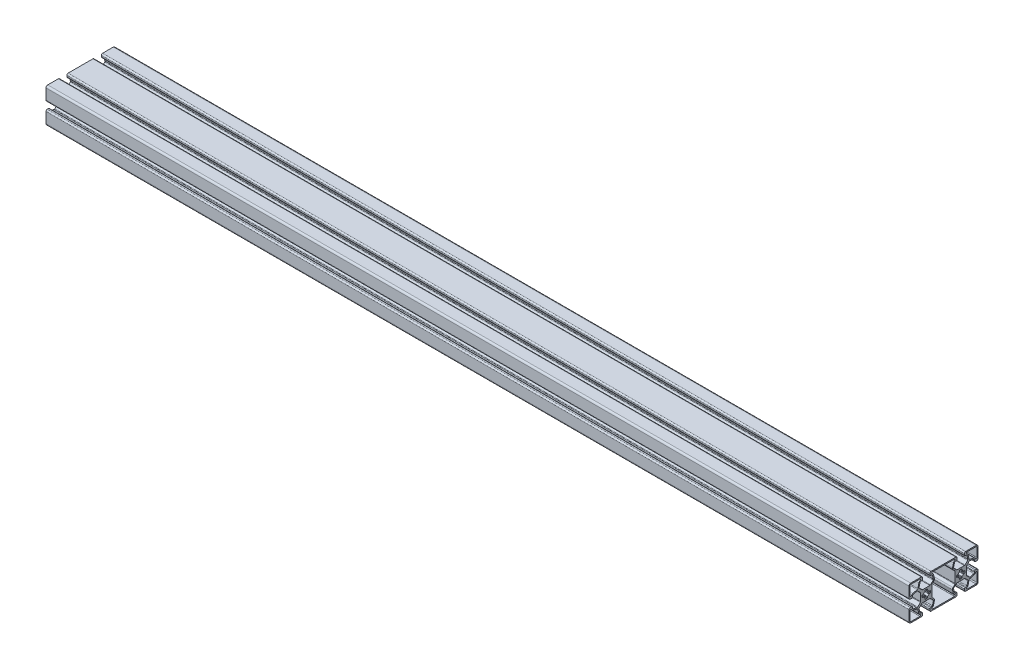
from build123d import *

# Parameters (mm, degrees)
EXTRUDE_1_DEPTH = 1000


with BuildPart() as part:
    # Sketch 1 → Extrude 1 (new body)
    with BuildSketch(Plane(origin=(0, 0, 0), x_dir=(0, 0, -1), z_dir=(1, 0, 0))):
        with BuildLine():
            Line((34.849999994, 15.999999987), (33.78085943, 15.999999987))
            ThreePointArc((33.78085943, 15.999999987), (33.165406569, 15.788173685), (32.810691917, 15.242435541))
            Line((32.810691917, 15.242435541), (31.705446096, 10.819513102))
            ThreePointArc((31.705446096, 10.819513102), (31.711912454, 10.310094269), (31.968506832, 9.869970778))
            Line((31.968506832, 9.869970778), (35.045584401, 6.792893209))
            ThreePointArc((35.045584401, 6.792893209), (35.370007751, 6.576120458), (35.752691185, 6.499999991))
            Line((35.752691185, 6.499999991), (44.2473088, 6.499999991))
            ThreePointArc((44.2473088, 6.499999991), (44.629992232, 6.576120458), (44.954415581, 6.792893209))
            Line((44.954415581, 6.792893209), (48.031493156, 9.869970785))
            ThreePointArc((48.031493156, 9.869970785), (48.288087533, 10.310094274), (48.294553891, 10.819513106))
            Line((48.294553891, 10.819513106), (47.189308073, 15.242435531))
            ThreePointArc((47.189308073, 15.242435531), (46.834593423, 15.788173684), (46.219140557, 15.999999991))
            Line((46.219140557, 15.999999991), (45.149999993, 15.999999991))
            ThreePointArc((45.149999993, 15.999999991), (44.442893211, 16.292893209), (44.149999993, 16.999999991))
            Line((44.149999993, 16.999999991), (44.149999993, 18.499999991))
            ThreePointArc((44.149999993, 18.499999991), (44.589339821, 19.560660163), (45.649999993, 19.999999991))
            Line((45.649999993, 19.999999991), (57.999999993, 19.999999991))
            ThreePointArc((57.999999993, 19.999999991), (59.414213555, 19.414213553), (59.999999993, 17.999999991))
            Line((59.999999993, 17.999999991), (59.999999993, 5.649999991))
            ThreePointArc((59.999999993, 5.649999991), (59.560660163, 4.589339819), (58.499999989, 4.149999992))
            Line((58.499999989, 4.149999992), (56.999999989, 4.149999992))
            ThreePointArc((56.999999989, 4.149999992), (56.292893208, 4.442893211), (55.999999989, 5.149999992))
            Line((55.999999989, 5.149999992), (55.999999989, 6.219140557))
            ThreePointArc((55.999999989, 6.219140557), (55.788173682, 6.834593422), (55.24243553, 7.189308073))
            Line((55.24243553, 7.189308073), (50.819513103, 8.294553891))
            ThreePointArc((50.819513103, 8.294553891), (50.310094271, 8.288087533), (49.869970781, 8.031493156))
            Line((49.869970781, 8.031493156), (46.792893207, 4.954415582))
            ThreePointArc((46.792893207, 4.954415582), (46.576120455, 4.629992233), (46.499999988, 4.2473088))
            Line((46.499999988, 4.2473088), (46.499999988, -4.247308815))
            ThreePointArc((46.499999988, -4.247308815), (46.576120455, -4.629992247), (46.792893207, -4.954415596))
            Line((46.792893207, -4.954415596), (49.869970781, -8.03149317))
            ThreePointArc((49.869970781, -8.03149317), (50.310094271, -8.288087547), (50.819513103, -8.294553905))
            Line((50.819513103, -8.294553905), (55.242435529, -7.189308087))
            ThreePointArc((55.242435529, -7.189308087), (55.788173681, -6.834593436), (55.999999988, -6.219140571))
            Line((55.999999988, -6.219140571), (55.999999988, -5.150000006))
            ThreePointArc((55.999999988, -5.150000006), (56.292893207, -4.442893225), (56.999999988, -4.150000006))
            Line((56.999999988, -4.150000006), (58.499999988, -4.150000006))
            ThreePointArc((58.499999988, -4.150000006), (59.56066016, -4.589339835), (59.999999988, -5.650000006))
            Line((59.999999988, -5.650000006), (59.999999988, -18.000000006))
            ThreePointArc((59.999999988, -18.000000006), (59.414213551, -19.414213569), (57.999999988, -20.000000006))
            Line((57.999999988, -20.000000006), (45.649999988, -20.000000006))
            ThreePointArc((45.649999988, -20.000000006), (44.589339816, -19.560660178), (44.149999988, -18.500000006))
            Line((44.149999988, -18.500000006), (44.149999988, -17.000000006))
            ThreePointArc((44.149999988, -17.000000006), (44.442893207, -16.292893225), (45.149999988, -16.000000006))
            Line((45.149999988, -16.000000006), (46.219140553, -16.000000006))
            ThreePointArc((46.219140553, -16.000000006), (46.834593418, -15.788173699), (47.189308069, -15.242435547))
            Line((47.189308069, -15.242435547), (48.294553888, -10.819513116))
            ThreePointArc((48.294553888, -10.819513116), (48.28808753, -10.310094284), (48.031493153, -9.869970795))
            Line((48.031493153, -9.869970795), (44.95441558, -6.792893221))
            ThreePointArc((44.95441558, -6.792893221), (44.62999223, -6.57612047), (44.247308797, -6.500000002))
            Line((44.247308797, -6.500000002), (35.752691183, -6.500000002))
            ThreePointArc((35.752691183, -6.500000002), (35.370007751, -6.576120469), (35.045584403, -6.79289322))
            Line((35.045584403, -6.79289322), (31.96850683, -9.869970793))
            ThreePointArc((31.96850683, -9.869970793), (31.711912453, -10.310094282), (31.705446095, -10.819513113))
            Line((31.705446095, -10.819513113), (32.810691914, -15.242435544))
            ThreePointArc((32.810691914, -15.242435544), (33.165406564, -15.788173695), (33.780859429, -16.000000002))
            Line((33.780859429, -16.000000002), (34.849999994, -16.000000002))
            ThreePointArc((34.849999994, -16.000000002), (35.557106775, -16.292893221), (35.849999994, -17.000000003))
            Line((35.849999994, -17.000000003), (35.849999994, -18.500000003))
            ThreePointArc((35.849999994, -18.500000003), (35.410660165, -19.560660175), (34.349999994, -20.000000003))
            Line((34.349999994, -20.000000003), (5.649999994, -20.000000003))
            ThreePointArc((5.649999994, -20.000000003), (4.589339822, -19.560660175), (4.149999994, -18.500000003))
            Line((4.149999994, -18.500000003), (4.149999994, -17.000000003))
            ThreePointArc((4.149999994, -17.000000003), (4.442893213, -16.292893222), (5.149999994, -16.000000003))
            Line((5.149999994, -16.000000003), (6.219140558, -16.000000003))
            ThreePointArc((6.219140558, -16.000000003), (6.834593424, -15.788173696), (7.189308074, -15.242435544))
            Line((7.189308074, -15.242435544), (8.294553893, -10.819513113))
            ThreePointArc((8.294553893, -10.819513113), (8.288087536, -10.310094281), (8.031493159, -9.869970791))
            Line((8.031493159, -9.869970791), (4.954415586, -6.792893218))
            ThreePointArc((4.954415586, -6.792893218), (4.629992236, -6.576120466), (4.247308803, -6.499999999))
            Line((4.247308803, -6.499999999), (-4.247308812, -6.499999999))
            ThreePointArc((-4.247308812, -6.499999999), (-4.629992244, -6.576120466), (-4.954415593, -6.792893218))
            Line((-4.954415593, -6.792893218), (-8.031493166, -9.869970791))
            ThreePointArc((-8.031493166, -9.869970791), (-8.288087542, -10.310094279), (-8.2945539, -10.81951311))
            Line((-8.2945539, -10.81951311), (-7.18930808, -15.24243554))
            ThreePointArc((-7.18930808, -15.24243554), (-6.83459343, -15.788173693), (-6.219140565, -16))
            Line((-6.219140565, -16), (-5.15, -16))
            ThreePointArc((-5.15, -16), (-4.442893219, -16.292893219), (-4.15, -17))
            Line((-4.15, -17), (-4.15, -18.5))
            ThreePointArc((-4.15, -18.5), (-4.589339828, -19.560660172), (-5.65, -20))
            Line((-5.65, -20), (-18, -20))
            ThreePointArc((-18, -20), (-19.414213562, -19.414213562), (-20, -18))
            Line((-20, -18), (-20, -5.65))
            ThreePointArc((-20, -5.65), (-19.560660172, -4.589339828), (-18.5, -4.15))
            Line((-18.5, -4.15), (-17, -4.15))
            ThreePointArc((-17, -4.15), (-16.292893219, -4.442893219), (-16, -5.15))
            Line((-16, -5.15), (-16, -6.219140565))
            ThreePointArc((-16, -6.219140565), (-15.788173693, -6.83459343), (-15.242435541, -7.18930808))
            Line((-15.242435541, -7.18930808), (-10.819513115, -8.294553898))
            ThreePointArc((-10.819513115, -8.294553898), (-10.310094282, -8.288087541), (-9.869970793, -8.031493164))
            Line((-9.869970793, -8.031493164), (-6.792893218, -4.954415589))
            ThreePointArc((-6.792893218, -4.954415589), (-6.576120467, -4.62999224), (-6.499999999, -4.247308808))
            Line((-6.499999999, -4.247308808), (-6.499999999, 4.247308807))
            ThreePointArc((-6.499999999, 4.247308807), (-6.576120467, 4.629992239), (-6.792893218, 4.954415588))
            Line((-6.792893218, 4.954415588), (-9.869970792, 8.031493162))
            ThreePointArc((-9.869970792, 8.031493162), (-10.310094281, 8.288087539), (-10.819513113, 8.294553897))
            Line((-10.819513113, 8.294553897), (-15.24243554, 7.189308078))
            ThreePointArc((-15.24243554, 7.189308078), (-15.788173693, 6.834593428), (-16, 6.219140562))
            Line((-16, 6.219140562), (-16, 5.149999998))
            ThreePointArc((-16, 5.149999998), (-16.292893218, 4.442893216), (-17, 4.149999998))
            Line((-17, 4.149999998), (-18.5, 4.149999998))
            ThreePointArc((-18.5, 4.149999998), (-19.560660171, 4.589339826), (-20, 5.649999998))
            Line((-20, 5.649999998), (-20, 17.999999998))
            ThreePointArc((-20, 17.999999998), (-19.414213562, 19.41421356), (-18, 19.999999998))
            Line((-18, 19.999999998), (-5.65, 19.999999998))
            ThreePointArc((-5.65, 19.999999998), (-4.589339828, 19.560660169), (-4.15, 18.499999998))
            Line((-4.15, 18.499999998), (-4.15, 16.999999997))
            ThreePointArc((-4.15, 16.999999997), (-4.442893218, 16.292893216), (-5.15, 15.999999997))
            Line((-5.15, 15.999999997), (-6.219140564, 15.999999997))
            ThreePointArc((-6.219140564, 15.999999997), (-6.83459343, 15.78817369), (-7.18930808, 15.242435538))
            Line((-7.18930808, 15.242435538), (-8.294553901, 10.819513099))
            ThreePointArc((-8.294553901, 10.819513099), (-8.288087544, 10.310094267), (-8.031493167, 9.869970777))
            Line((-8.031493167, 9.869970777), (-4.954415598, 6.792893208))
            ThreePointArc((-4.954415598, 6.792893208), (-4.629992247, 6.576120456), (-4.247308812, 6.499999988))
            Line((-4.247308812, 6.499999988), (4.247308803, 6.499999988))
            ThreePointArc((4.247308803, 6.499999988), (4.629992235, 6.576120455), (4.954415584, 6.792893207))
            Line((4.954415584, 6.792893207), (8.031493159, 9.869970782))
            ThreePointArc((8.031493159, 9.869970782), (8.288087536, 10.310094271), (8.294553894, 10.819513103))
            Line((8.294553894, 10.819513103), (7.189308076, 15.242435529))
            ThreePointArc((7.189308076, 15.242435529), (6.834593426, 15.788173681), (6.21914056, 15.999999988))
            Line((6.21914056, 15.999999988), (5.149999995, 15.999999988))
            ThreePointArc((5.149999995, 15.999999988), (4.442893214, 16.292893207), (4.149999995, 16.999999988))
            Line((4.149999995, 16.999999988), (4.149999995, 18.499999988))
            ThreePointArc((4.149999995, 18.499999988), (4.589339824, 19.56066016), (5.649999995, 19.999999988))
            Line((5.649999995, 19.999999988), (34.349999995, 19.999999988))
            ThreePointArc((34.349999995, 19.999999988), (35.410660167, 19.56066016), (35.849999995, 18.499999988))
            Line((35.849999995, 18.499999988), (35.849999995, 16.999999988))
            ThreePointArc((35.849999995, 16.999999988), (35.557106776, 16.292893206), (34.849999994, 15.999999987))
        make_face()
        with BuildLine():
            Line((-4.8, -0.75), (-4.8, 0.75))
            ThreePointArc((-4.8, 0.75), (-4.653553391, 1.103553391), (-4.3, 1.25))
            Line((-4.3, 1.25), (-3.485326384, 1.25))
            ThreePointArc((-3.485326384, 1.25), (-3.222818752, 1.324453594), (-3.038489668, 1.525641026))
            ThreePointArc((-3.038489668, 1.525641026), (-2.404163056, 2.404163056), (-1.525641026, 3.038489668))
            ThreePointArc((-1.525641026, 3.038489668), (-1.324453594, 3.222818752), (-1.25, 3.485326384))
            Line((-1.25, 3.485326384), (-1.25, 4.3))
            ThreePointArc((-1.25, 4.3), (-1.103553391, 4.653553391), (-0.75, 4.8))
            Line((-0.75, 4.8), (0.75, 4.8))
            ThreePointArc((0.75, 4.8), (1.103553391, 4.653553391), (1.25, 4.3))
            Line((1.25, 4.3), (1.25, 3.485326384))
            ThreePointArc((1.25, 3.485326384), (1.324453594, 3.222818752), (1.525641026, 3.038489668))
            ThreePointArc((1.525641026, 3.038489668), (2.404163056, 2.404163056), (3.038489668, 1.525641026))
            ThreePointArc((3.038489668, 1.525641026), (3.222818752, 1.324453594), (3.485326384, 1.25))
            Line((3.485326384, 1.25), (4.3, 1.25))
            ThreePointArc((4.3, 1.25), (4.653553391, 1.103553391), (4.8, 0.75))
            Line((4.8, 0.75), (4.8, -0.75))
            ThreePointArc((4.8, -0.75), (4.653553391, -1.103553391), (4.3, -1.25))
            Line((4.3, -1.25), (3.485326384, -1.25))
            ThreePointArc((3.485326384, -1.25), (3.222818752, -1.324453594), (3.038489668, -1.525641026))
            ThreePointArc((3.038489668, -1.525641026), (2.404163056, -2.404163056), (1.525641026, -3.038489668))
            ThreePointArc((1.525641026, -3.038489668), (1.324453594, -3.222818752), (1.25, -3.485326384))
            Line((1.25, -3.485326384), (1.25, -4.3))
            ThreePointArc((1.25, -4.3), (1.103553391, -4.653553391), (0.75, -4.8))
            Line((0.75, -4.8), (-0.75, -4.8))
            ThreePointArc((-0.75, -4.8), (-1.103553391, -4.653553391), (-1.25, -4.3))
            Line((-1.25, -4.3), (-1.25, -3.485326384))
            ThreePointArc((-1.25, -3.485326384), (-1.324453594, -3.222818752), (-1.525641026, -3.038489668))
            ThreePointArc((-1.525641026, -3.038489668), (-2.404163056, -2.404163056), (-3.038489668, -1.525641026))
            ThreePointArc((-3.038489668, -1.525641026), (-3.222818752, -1.324453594), (-3.485326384, -1.25))
            Line((-3.485326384, -1.25), (-4.3, -1.25))
            ThreePointArc((-4.3, -1.25), (-4.653553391, -1.103553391), (-4.8, -0.75))
        make_face(mode=Mode.SUBTRACT)
        with BuildLine():
            Line((6.499999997, 6.085786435), (6.499999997, -6.085786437))
            ThreePointArc((6.499999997, -6.085786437), (6.576120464, -6.468469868), (6.792893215, -6.792893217))
            Line((6.792893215, -6.792893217), (8.950731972, -8.950731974))
            ThreePointArc((8.950731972, -8.950731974), (9.540899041, -9.963016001), (9.555771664, -11.134679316))
            Line((9.555771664, -11.134679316), (8.450525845, -15.557601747))
            ThreePointArc((8.450525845, -15.557601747), (7.937252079, -16.529082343), (7.031890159, -17.151612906))
            ThreePointArc((7.031890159, -17.151612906), (6.52759467, -18.043684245), (7.314585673, -18.700000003))
            Line((7.314585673, -18.700000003), (32.685414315, -18.700000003))
            ThreePointArc((32.685414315, -18.700000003), (33.472405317, -18.043684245), (32.968109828, -17.151612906))
            ThreePointArc((32.968109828, -17.151612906), (32.062747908, -16.529082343), (31.549474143, -15.557601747))
            Line((31.549474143, -15.557601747), (30.444228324, -11.134679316))
            ThreePointArc((30.444228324, -11.134679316), (30.459100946, -9.963016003), (31.049268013, -8.950731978))
            Line((31.049268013, -8.950731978), (33.207106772, -6.792893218))
            ThreePointArc((33.207106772, -6.792893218), (33.423879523, -6.46846987), (33.499999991, -6.085786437))
            Line((33.499999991, -6.085786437), (33.499999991, 6.085786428))
            ThreePointArc((33.499999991, 6.085786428), (33.423879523, 6.468469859), (33.207106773, 6.792893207))
            Line((33.207106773, 6.792893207), (31.049268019, 8.95073196))
            ThreePointArc((31.049268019, 8.95073196), (30.459100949, 9.963015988), (30.444228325, 11.134679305))
            Line((30.444228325, 11.134679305), (31.549474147, 15.557601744))
            ThreePointArc((31.549474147, 15.557601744), (32.062747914, 16.529082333), (32.96810983, 17.151612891))
            ThreePointArc((32.96810983, 17.151612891), (33.472405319, 18.04368423), (32.685414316, 18.699999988))
            Line((32.685414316, 18.699999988), (7.314585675, 18.699999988))
            ThreePointArc((7.314585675, 18.699999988), (6.527594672, 18.04368423), (7.031890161, 17.151612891))
            ThreePointArc((7.031890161, 17.151612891), (7.937252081, 16.529082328), (8.450525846, 15.557601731))
            Line((8.450525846, 15.557601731), (9.555771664, 11.134679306))
            ThreePointArc((9.555771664, 11.134679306), (9.540899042, 9.963015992), (8.950731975, 8.950731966))
            Line((8.950731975, 8.950731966), (6.792893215, 6.792893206))
            ThreePointArc((6.792893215, 6.792893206), (6.576120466, 6.468469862), (6.499999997, 6.085786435))
        make_face(mode=Mode.SUBTRACT)
        with BuildLine():
            Line((44.8, -0.75), (44.8, 0.75))
            ThreePointArc((44.8, 0.75), (44.653553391, 1.103553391), (44.3, 1.25))
            Line((44.3, 1.25), (43.485326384, 1.25))
            ThreePointArc((43.485326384, 1.25), (43.222818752, 1.324453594), (43.038489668, 1.525641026))
            ThreePointArc((43.038489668, 1.525641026), (42.404163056, 2.404163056), (41.525641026, 3.038489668))
            ThreePointArc((41.525641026, 3.038489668), (41.324453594, 3.222818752), (41.25, 3.485326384))
            Line((41.25, 3.485326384), (41.25, 4.3))
            ThreePointArc((41.25, 4.3), (41.103553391, 4.653553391), (40.75, 4.8))
            Line((40.75, 4.8), (39.25, 4.8))
            ThreePointArc((39.25, 4.8), (38.896446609, 4.653553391), (38.75, 4.3))
            Line((38.75, 4.3), (38.75, 3.485326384))
            ThreePointArc((38.75, 3.485326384), (38.675546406, 3.222818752), (38.474358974, 3.038489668))
            ThreePointArc((38.474358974, 3.038489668), (37.595836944, 2.404163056), (36.961510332, 1.525641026))
            ThreePointArc((36.961510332, 1.525641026), (36.777181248, 1.324453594), (36.514673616, 1.25))
            Line((36.514673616, 1.25), (35.7, 1.25))
            ThreePointArc((35.7, 1.25), (35.346446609, 1.103553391), (35.2, 0.75))
            Line((35.2, 0.75), (35.2, -0.75))
            ThreePointArc((35.2, -0.75), (35.346446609, -1.103553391), (35.7, -1.25))
            Line((35.7, -1.25), (36.514673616, -1.25))
            ThreePointArc((36.514673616, -1.25), (36.777181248, -1.324453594), (36.961510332, -1.525641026))
            ThreePointArc((36.961510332, -1.525641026), (37.595836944, -2.404163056), (38.474358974, -3.038489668))
            ThreePointArc((38.474358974, -3.038489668), (38.675546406, -3.222818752), (38.75, -3.485326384))
            Line((38.75, -3.485326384), (38.75, -4.3))
            ThreePointArc((38.75, -4.3), (38.896446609, -4.653553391), (39.25, -4.8))
            Line((39.25, -4.8), (40.75, -4.8))
            ThreePointArc((40.75, -4.8), (41.103553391, -4.653553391), (41.25, -4.3))
            Line((41.25, -4.3), (41.25, -3.485326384))
            ThreePointArc((41.25, -3.485326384), (41.324453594, -3.222818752), (41.525641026, -3.038489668))
            ThreePointArc((41.525641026, -3.038489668), (42.404163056, -2.404163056), (43.038489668, -1.525641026))
            ThreePointArc((43.038489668, -1.525641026), (43.222818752, -1.324453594), (43.485326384, -1.25))
            Line((43.485326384, -1.25), (44.3, -1.25))
            ThreePointArc((44.3, -1.25), (44.653553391, -1.103553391), (44.8, -0.75))
        make_face(mode=Mode.SUBTRACT)
        with BuildLine():
            Line((-18.7, -17.7), (-18.7, -7.31458568))
            ThreePointArc((-18.7, -7.31458568), (-18.043684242, -6.527594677), (-17.151612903, -7.031890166))
            ThreePointArc((-17.151612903, -7.031890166), (-16.52908234, -7.937252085), (-15.557601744, -8.450525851))
            Line((-15.557601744, -8.450525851), (-10.453679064, -9.725947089))
            ThreePointArc((-10.453679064, -9.725947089), (-9.989007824, -9.989007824), (-9.725947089, -10.453679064))
            Line((-9.725947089, -10.453679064), (-8.450525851, -15.557601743))
            ThreePointArc((-8.450525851, -15.557601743), (-7.937252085, -16.52908234), (-7.031890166, -17.151612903))
            ThreePointArc((-7.031890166, -17.151612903), (-6.527594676, -18.043684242), (-7.314585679, -18.7))
            Line((-7.314585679, -18.7), (-17.7, -18.7))
            ThreePointArc((-17.7, -18.7), (-18.407106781, -18.407106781), (-18.7, -17.7))
        make_face(mode=Mode.SUBTRACT)
        with BuildLine():
            Line((47.314585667, -18.700000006), (57.699999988, -18.700000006))
            ThreePointArc((57.699999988, -18.700000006), (58.407106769, -18.407106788), (58.699999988, -17.700000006))
            Line((58.699999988, -17.700000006), (58.699999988, -7.314585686))
            ThreePointArc((58.699999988, -7.314585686), (58.04368423, -6.527594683), (57.151612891, -7.031890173))
            ThreePointArc((57.151612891, -7.031890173), (56.529082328, -7.937252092), (55.557601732, -8.450525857))
            Line((55.557601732, -8.450525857), (50.453679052, -9.725947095))
            ThreePointArc((50.453679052, -9.725947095), (49.989007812, -9.98900783), (49.725947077, -10.453679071))
            Line((49.725947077, -10.453679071), (48.450525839, -15.55760175))
            ThreePointArc((48.450525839, -15.55760175), (47.937252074, -16.529082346), (47.031890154, -17.15161291))
            ThreePointArc((47.031890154, -17.15161291), (46.527594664, -18.043684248), (47.314585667, -18.700000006))
        make_face(mode=Mode.SUBTRACT)
        with BuildLine():
            Line((47.314585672, 18.699999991), (57.699999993, 18.699999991))
            ThreePointArc((57.699999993, 18.699999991), (58.407106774, 18.407106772), (58.699999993, 17.699999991))
            Line((58.699999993, 17.699999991), (58.699999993, 7.314585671))
            ThreePointArc((58.699999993, 7.314585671), (58.043684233, 6.527594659), (57.151612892, 7.031890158))
            ThreePointArc((57.151612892, 7.031890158), (56.52908233, 7.937252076), (55.557601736, 8.450525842))
            Line((55.557601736, 8.450525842), (50.453679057, 9.72594708))
            ThreePointArc((50.453679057, 9.72594708), (49.989007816, 9.989007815), (49.725947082, 10.453679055))
            Line((49.725947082, 10.453679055), (48.450525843, 15.557601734))
            ThreePointArc((48.450525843, 15.557601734), (47.937252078, 16.529082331), (47.031890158, 17.151612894))
            ThreePointArc((47.031890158, 17.151612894), (46.527594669, 18.043684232), (47.314585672, 18.699999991))
        make_face(mode=Mode.SUBTRACT)
        with BuildLine():
            Line((-18.7, 17.699999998), (-18.7, 7.314585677))
            ThreePointArc((-18.7, 7.314585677), (-18.043684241, 6.527594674), (-17.151612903, 7.031890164))
            ThreePointArc((-17.151612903, 7.031890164), (-16.529082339, 7.937252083), (-15.557601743, 8.450525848))
            Line((-15.557601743, 8.450525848), (-10.453679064, 9.725947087))
            ThreePointArc((-10.453679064, 9.725947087), (-9.989007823, 9.989007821), (-9.725947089, 10.453679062))
            Line((-9.725947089, 10.453679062), (-8.45052585, 15.557601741))
            ThreePointArc((-8.45052585, 15.557601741), (-7.937252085, 16.529082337), (-7.031890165, 17.151612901))
            ThreePointArc((-7.031890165, 17.151612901), (-6.527594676, 18.043684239), (-7.314585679, 18.699999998))
            Line((-7.314585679, 18.699999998), (-17.7, 18.699999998))
            ThreePointArc((-17.7, 18.699999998), (-18.407106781, 18.407106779), (-18.7, 17.699999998))
        make_face(mode=Mode.SUBTRACT)
    extrude(amount=EXTRUDE_1_DEPTH)


solid = part.part
